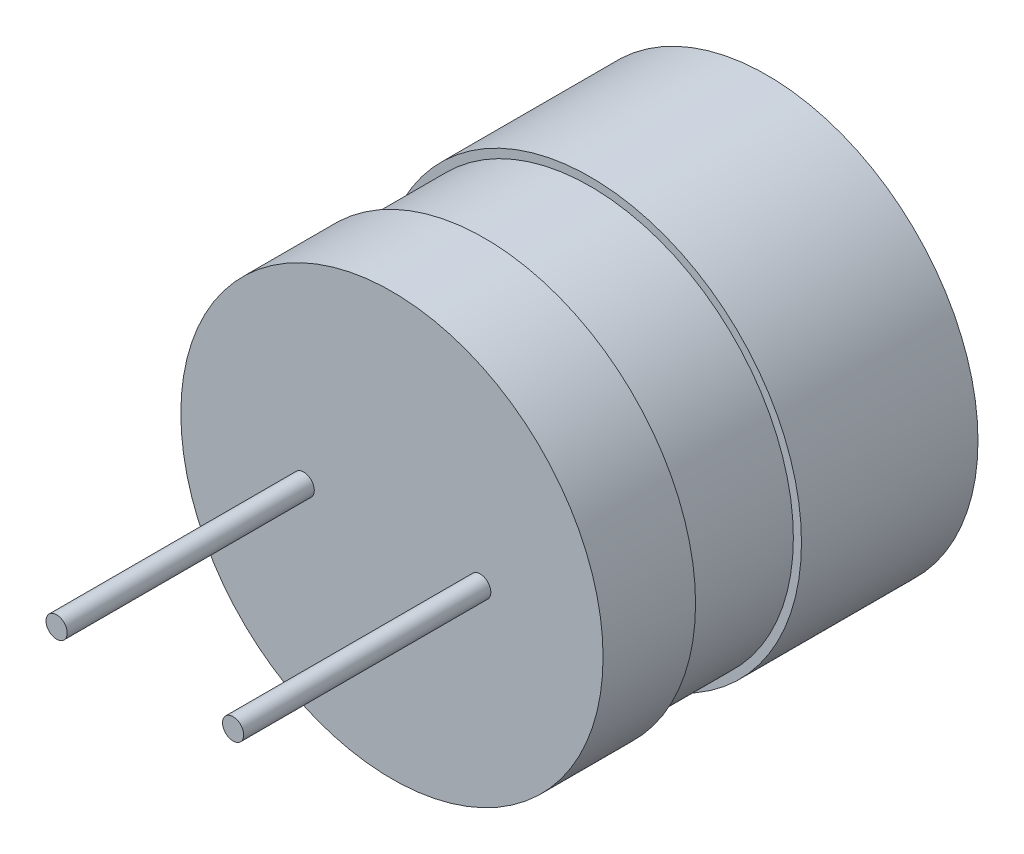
from build123d import *

# Parameters (mm, degrees)
SKETCH1_R           = 5.98
BOSS_EXTRUDE1_DEPTH = 5
SKETCH2_R           = 1.25
CUT_EXTRUDE1_DEPTH  = 5
SKETCH3_R           = 5.75
BOSS_EXTRUDE2_DEPTH = 3
SKETCH4_R           = 5.98
BOSS_EXTRUDE3_DEPTH = 2.62
SKETCH5_R           = 0.645
BOSS_EXTRUDE4_DEPTH = 7
CUT_EXTRUDE2_START  = -7
SKETCH6_R           = 0.645
SKETCH6_R_2         = 0.3
CUT_EXTRUDE2_DEPTH  = 7


with BuildPart() as part:
    # Sketch1 → Boss-Extrude1 (new body)
    with BuildSketch(Plane.XY):
        Circle(SKETCH1_R)
    extrude(amount=BOSS_EXTRUDE1_DEPTH)

    # Sketch2 → Cut-Extrude1 (cut)
    with BuildSketch(Plane(origin=(0, 0, 0), x_dir=(-1, 0, 0), z_dir=(0, 0, -1))):
        Circle(SKETCH2_R)
    extrude(amount=-CUT_EXTRUDE1_DEPTH, mode=Mode.SUBTRACT)

    # Sketch3 → Boss-Extrude2 (add)
    with BuildSketch(Plane.XY.offset(5)):
        Circle(SKETCH3_R)
    extrude(amount=BOSS_EXTRUDE2_DEPTH)

    # Sketch4 → Boss-Extrude3 (add)
    with BuildSketch(Plane.XY.offset(8)):
        Circle(SKETCH4_R)
    extrude(amount=BOSS_EXTRUDE3_DEPTH)

    # Sketch5 → Boss-Extrude4 (add)
    with BuildSketch(Plane.XY.offset(10.62)):
        with Locations((-2.5, 0)):
            Circle(SKETCH5_R)
        with Locations((2.5, 0)):
            Circle(SKETCH5_R)
    extrude(amount=BOSS_EXTRUDE4_DEPTH)

    # Sketch6 → Cut-Extrude2 (cut)
    # profile 1 of 2: a face of its own
    with BuildSketch(Plane.XY.offset(17.62).offset(CUT_EXTRUDE2_START)):
        with Locations((-2.5, 0)):
            Circle(SKETCH6_R)
        with Locations((-2.5, 0)):
            Circle(SKETCH6_R_2, mode=Mode.SUBTRACT)
    # profile 2 of 2: a face of its own
    with BuildSketch(Plane.XY.offset(17.62).offset(CUT_EXTRUDE2_START)):
        with Locations((2.5, 0)):
            Circle(SKETCH6_R)
        with Locations((2.5, 0)):
            Circle(SKETCH6_R_2, mode=Mode.SUBTRACT)
    extrude(amount=CUT_EXTRUDE2_DEPTH, mode=Mode.SUBTRACT)


solid = part.part
